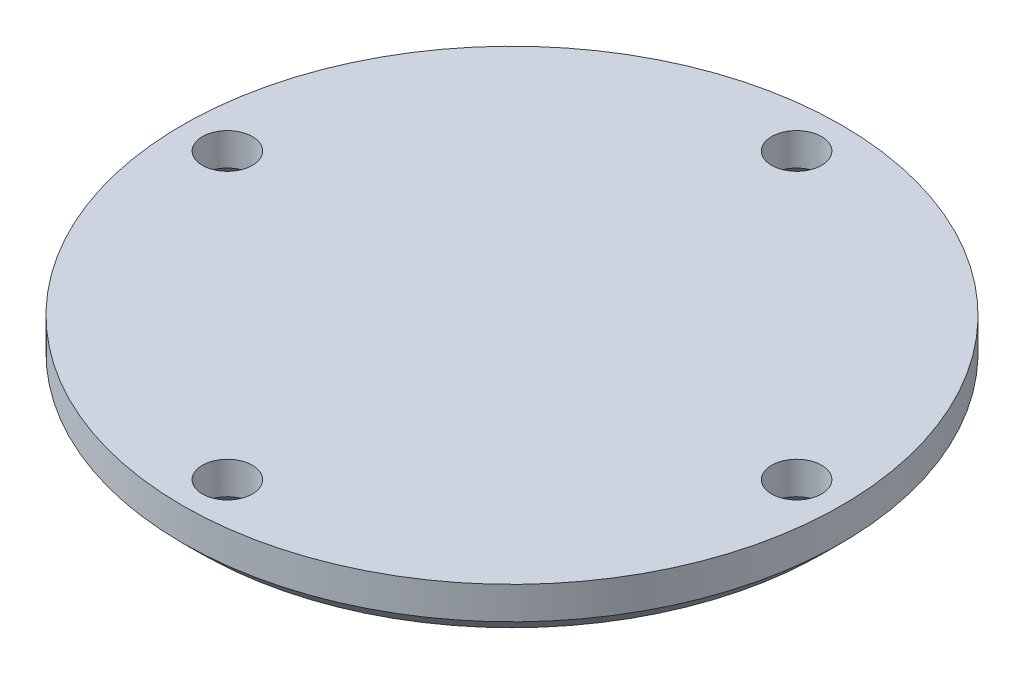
ISO-10303-21;
HEADER;
FILE_DESCRIPTION(('STEP AP214'),'2;1');
FILE_NAME('part.step','',(''),(''),'','','');
FILE_SCHEMA(('AUTOMOTIVE_DESIGN { 1 0 10303 214 1 1 1 1 }'));
ENDSEC;
DATA;
#1=APPLICATION_CONTEXT('core data for automotive mechanical design processes');
#2=APPLICATION_PROTOCOL_DEFINITION('international standard','automotive_design',2000,#1);
#3=PRODUCT_CONTEXT('',#1,'mechanical');
#4=PRODUCT('Part','Part','',(#3));
#5=PRODUCT_RELATED_PRODUCT_CATEGORY('part','',(#4));
#6=PRODUCT_DEFINITION_FORMATION('','',#4);
#7=PRODUCT_DEFINITION_CONTEXT('part definition',#1,'design');
#8=PRODUCT_DEFINITION('design','',#6,#7);
#9=PRODUCT_DEFINITION_SHAPE('','',#8);
#10=(LENGTH_UNIT() NAMED_UNIT(*) SI_UNIT(.MILLI.,.METRE.));
#11=(NAMED_UNIT(*) PLANE_ANGLE_UNIT() SI_UNIT($,.RADIAN.));
#12=(NAMED_UNIT(*) SI_UNIT($,.STERADIAN.) SOLID_ANGLE_UNIT());
#13=UNCERTAINTY_MEASURE_WITH_UNIT(LENGTH_MEASURE(1.E-05),#10,'distance_accuracy_value','');
#14=(GEOMETRIC_REPRESENTATION_CONTEXT(3) GLOBAL_UNCERTAINTY_ASSIGNED_CONTEXT((#13)) GLOBAL_UNIT_ASSIGNED_CONTEXT((#10,
#11,#12)) REPRESENTATION_CONTEXT('',''));
#15=CARTESIAN_POINT('',(0.,0.,0.));
#16=DIRECTION('',(0.,0.,1.));
#17=DIRECTION('',(1.,0.,0.));
#18=AXIS2_PLACEMENT_3D('',#15,#16,#17);
#19=CARTESIAN_POINT('',(0.,5.,0.));
#20=DIRECTION('',(0.,-1.,0.));
#21=DIRECTION('',(0.,0.,-1.));
#22=AXIS2_PLACEMENT_3D('',#19,#20,#21);
#23=CYLINDRICAL_SURFACE('',#22,33.);
#24=CARTESIAN_POINT('',(0.,1.75000000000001,0.));
#25=DIRECTION('',(0.,1.,0.));
#26=DIRECTION('',(0.,0.,1.));
#27=AXIS2_PLACEMENT_3D('',#24,#25,#26);
#28=CIRCLE('',#27,33.);
#29=CARTESIAN_POINT('',(0.,1.75000000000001,33.));
#30=VERTEX_POINT('',#29);
#31=EDGE_CURVE('E114',#30,#30,#28,.T.);
#32=ORIENTED_EDGE('',*,*,#31,.T.);
#33=EDGE_LOOP('',(#32));
#34=FACE_BOUND('',#33,.T.);
#35=CARTESIAN_POINT('',(0.,5.,0.));
#36=DIRECTION('',(0.,1.,0.));
#37=DIRECTION('',(0.,0.,1.));
#38=AXIS2_PLACEMENT_3D('',#35,#36,#37);
#39=CIRCLE('',#38,33.);
#40=CARTESIAN_POINT('',(0.,5.,33.));
#41=VERTEX_POINT('',#40);
#42=EDGE_CURVE('E118',#41,#41,#39,.T.);
#43=ORIENTED_EDGE('',*,*,#42,.F.);
#44=EDGE_LOOP('',(#43));
#45=FACE_BOUND('',#44,.T.);
#46=ADVANCED_FACE('F43',(#34,#45),#23,.T.);
#47=CARTESIAN_POINT('',(0.,5.,0.));
#48=DIRECTION('',(0.,1.,0.));
#49=DIRECTION('',(0.,0.,1.));
#50=AXIS2_PLACEMENT_3D('',#47,#48,#49);
#51=PLANE('',#50);
#52=CARTESIAN_POINT('',(0.,5.,-28.5));
#53=DIRECTION('',(0.,1.,0.));
#54=DIRECTION('',(0.,0.,1.));
#55=AXIS2_PLACEMENT_3D('',#52,#53,#54);
#56=CIRCLE('',#55,2.5);
#57=CARTESIAN_POINT('',(0.,5.,-26.));
#58=VERTEX_POINT('',#57);
#59=EDGE_CURVE('E265',#58,#58,#56,.T.);
#60=ORIENTED_EDGE('',*,*,#59,.F.);
#61=EDGE_LOOP('',(#60));
#62=FACE_BOUND('',#61,.T.);
#63=CARTESIAN_POINT('',(28.5000000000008,5.,-8.04783353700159E-13));
#64=DIRECTION('',(0.,1.,0.));
#65=DIRECTION('',(0.,0.,1.));
#66=AXIS2_PLACEMENT_3D('',#63,#64,#65);
#67=CIRCLE('',#66,2.50000000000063);
#68=CARTESIAN_POINT('',(28.5000000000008,5.,2.49999999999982));
#69=VERTEX_POINT('',#68);
#70=EDGE_CURVE('E267',#69,#69,#67,.T.);
#71=ORIENTED_EDGE('',*,*,#70,.F.);
#72=EDGE_LOOP('',(#71));
#73=FACE_BOUND('',#72,.T.);
#74=CARTESIAN_POINT('',(1.60956670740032E-12,5.,28.5));
#75=DIRECTION('',(0.,1.,0.));
#76=DIRECTION('',(0.,0.,1.));
#77=AXIS2_PLACEMENT_3D('',#74,#75,#76);
#78=CIRCLE('',#77,2.50000000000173);
#79=CARTESIAN_POINT('',(1.60956670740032E-12,5.,31.0000000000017));
#80=VERTEX_POINT('',#79);
#81=EDGE_CURVE('E273',#80,#80,#78,.T.);
#82=ORIENTED_EDGE('',*,*,#81,.F.);
#83=EDGE_LOOP('',(#82));
#84=FACE_BOUND('',#83,.T.);
#85=CARTESIAN_POINT('',(-28.4999999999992,5.,8.08273597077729E-13));
#86=DIRECTION('',(0.,1.,0.));
#87=DIRECTION('',(0.,0.,1.));
#88=AXIS2_PLACEMENT_3D('',#85,#86,#87);
#89=CIRCLE('',#88,2.50000000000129);
#90=CARTESIAN_POINT('',(-28.4999999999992,5.,2.5000000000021));
#91=VERTEX_POINT('',#90);
#92=EDGE_CURVE('E214',#91,#91,#89,.T.);
#93=ORIENTED_EDGE('',*,*,#92,.F.);
#94=EDGE_LOOP('',(#93));
#95=FACE_BOUND('',#94,.T.);
#96=ORIENTED_EDGE('',*,*,#42,.T.);
#97=EDGE_LOOP('',(#96));
#98=FACE_BOUND('',#97,.T.);
#99=ADVANCED_FACE('F234',(#62,#73,#84,#95,#98),#51,.T.);
#100=CARTESIAN_POINT('',(0.,0.,0.));
#101=DIRECTION('',(0.,1.,0.));
#102=DIRECTION('',(0.,0.,1.));
#103=AXIS2_PLACEMENT_3D('',#100,#101,#102);
#104=PLANE('',#103);
#105=CARTESIAN_POINT('',(28.5000000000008,0.,-8.04783353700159E-13));
#106=DIRECTION('',(0.,1.,0.));
#107=DIRECTION('',(0.,0.,1.));
#108=AXIS2_PLACEMENT_3D('',#105,#106,#107);
#109=CIRCLE('',#108,4.25000000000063);
#110=CARTESIAN_POINT('',(28.5000000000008,0.,4.24999999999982));
#111=VERTEX_POINT('',#110);
#112=CARTESIAN_POINT('',(31.0657894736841,0.,3.38810040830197));
#113=VERTEX_POINT('',#112);
#114=EDGE_CURVE('E72',#111,#113,#109,.T.);
#115=ORIENTED_EDGE('',*,*,#114,.T.);
#116=CARTESIAN_POINT('',(0.,0.,0.));
#117=DIRECTION('',(0.,1.,0.));
#118=DIRECTION('',(0.,0.,1.));
#119=AXIS2_PLACEMENT_3D('',#116,#117,#118);
#120=CIRCLE('',#119,31.25);
#121=CARTESIAN_POINT('',(3.38810040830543,0.,31.0657894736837));
#122=VERTEX_POINT('',#121);
#123=EDGE_CURVE('E67',#113,#122,#120,.F.);
#124=ORIENTED_EDGE('',*,*,#123,.T.);
#125=CARTESIAN_POINT('',(1.60956670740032E-12,0.,28.5));
#126=DIRECTION('',(0.,1.,0.));
#127=DIRECTION('',(0.,0.,1.));
#128=AXIS2_PLACEMENT_3D('',#125,#126,#127);
#129=CIRCLE('',#128,4.25000000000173);
#130=CARTESIAN_POINT('',(-3.38810040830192,0.,31.0657894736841));
#131=VERTEX_POINT('',#130);
#132=EDGE_CURVE('E141',#122,#131,#129,.T.);
#133=ORIENTED_EDGE('',*,*,#132,.T.);
#134=CARTESIAN_POINT('',(0.,0.,0.));
#135=DIRECTION('',(0.,1.,0.));
#136=DIRECTION('',(0.,0.,1.));
#137=AXIS2_PLACEMENT_3D('',#134,#135,#136);
#138=CIRCLE('',#137,31.25);
#139=CARTESIAN_POINT('',(-31.065789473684,0.,3.38810040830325));
#140=VERTEX_POINT('',#139);
#141=EDGE_CURVE('E136',#131,#140,#138,.F.);
#142=ORIENTED_EDGE('',*,*,#141,.T.);
#143=CARTESIAN_POINT('',(-28.4999999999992,0.,8.08273597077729E-13));
#144=DIRECTION('',(0.,1.,0.));
#145=DIRECTION('',(0.,0.,1.));
#146=AXIS2_PLACEMENT_3D('',#143,#144,#145);
#147=CIRCLE('',#146,4.25000000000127);
#148=CARTESIAN_POINT('',(-28.4999999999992,0.,4.25000000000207));
#149=VERTEX_POINT('',#148);
#150=EDGE_CURVE('E133',#140,#149,#147,.T.);
#151=ORIENTED_EDGE('',*,*,#150,.T.);
#152=CARTESIAN_POINT('',(-28.4999999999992,0.,8.08273597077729E-13));
#153=DIRECTION('',(0.,1.,0.));
#154=DIRECTION('',(0.,0.,1.));
#155=AXIS2_PLACEMENT_3D('',#152,#153,#154);
#156=CIRCLE('',#155,4.25000000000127);
#157=CARTESIAN_POINT('',(-31.0657894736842,0.,-3.38810040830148));
#158=VERTEX_POINT('',#157);
#159=EDGE_CURVE('E130',#149,#158,#156,.T.);
#160=ORIENTED_EDGE('',*,*,#159,.T.);
#161=CARTESIAN_POINT('',(0.,0.,0.));
#162=DIRECTION('',(0.,1.,0.));
#163=DIRECTION('',(0.,0.,1.));
#164=AXIS2_PLACEMENT_3D('',#161,#162,#163);
#165=CIRCLE('',#164,31.25);
#166=CARTESIAN_POINT('',(-3.38810040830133,0.,-31.0657894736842));
#167=VERTEX_POINT('',#166);
#168=EDGE_CURVE('E106',#158,#167,#165,.F.);
#169=ORIENTED_EDGE('',*,*,#168,.T.);
#170=CARTESIAN_POINT('',(0.,0.,-28.5));
#171=DIRECTION('',(0.,1.,0.));
#172=DIRECTION('',(0.,0.,1.));
#173=AXIS2_PLACEMENT_3D('',#170,#171,#172);
#174=CIRCLE('',#173,4.25000000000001);
#175=CARTESIAN_POINT('',(0.,0.,-24.25));
#176=VERTEX_POINT('',#175);
#177=EDGE_CURVE('E99',#167,#176,#174,.T.);
#178=ORIENTED_EDGE('',*,*,#177,.T.);
#179=CARTESIAN_POINT('',(0.,0.,-28.5));
#180=DIRECTION('',(0.,1.,0.));
#181=DIRECTION('',(0.,0.,1.));
#182=AXIS2_PLACEMENT_3D('',#179,#180,#181);
#183=CIRCLE('',#182,4.25000000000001);
#184=CARTESIAN_POINT('',(3.38810040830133,0.,-31.0657894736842));
#185=VERTEX_POINT('',#184);
#186=EDGE_CURVE('E103',#176,#185,#183,.T.);
#187=ORIENTED_EDGE('',*,*,#186,.T.);
#188=CARTESIAN_POINT('',(0.,0.,0.));
#189=DIRECTION('',(0.,1.,0.));
#190=DIRECTION('',(0.,0.,1.));
#191=AXIS2_PLACEMENT_3D('',#188,#189,#190);
#192=CIRCLE('',#191,31.25);
#193=CARTESIAN_POINT('',(31.0657894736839,0.,-3.38810040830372));
#194=VERTEX_POINT('',#193);
#195=EDGE_CURVE('E124',#185,#194,#192,.F.);
#196=ORIENTED_EDGE('',*,*,#195,.T.);
#197=CARTESIAN_POINT('',(28.5000000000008,0.,-8.04783353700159E-13));
#198=DIRECTION('',(0.,1.,0.));
#199=DIRECTION('',(0.,0.,1.));
#200=AXIS2_PLACEMENT_3D('',#197,#198,#199);
#201=CIRCLE('',#200,4.25000000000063);
#202=EDGE_CURVE('E127',#194,#111,#201,.T.);
#203=ORIENTED_EDGE('',*,*,#202,.T.);
#204=EDGE_LOOP('',(#115,#124,#133,#142,#151,#160,#169,#178,#187,#196,#203));
#205=FACE_BOUND('',#204,.T.);
#206=ADVANCED_FACE('F101',(#205),#104,.F.);
#207=CARTESIAN_POINT('',(-28.4999999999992,0.,8.08273597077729E-13));
#208=DIRECTION('',(0.,1.,0.));
#209=DIRECTION('',(0.,0.,1.));
#210=AXIS2_PLACEMENT_3D('',#207,#208,#209);
#211=CYLINDRICAL_SURFACE('',#210,2.50000000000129);
#212=CARTESIAN_POINT('',(-28.4999999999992,1.74999999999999,8.08273597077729E-13));
#213=DIRECTION('',(0.,1.,0.));
#214=DIRECTION('',(0.,0.,1.));
#215=AXIS2_PLACEMENT_3D('',#212,#213,#214);
#216=CIRCLE('',#215,2.50000000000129);
#217=CARTESIAN_POINT('',(-28.4999999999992,1.74999999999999,2.5000000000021));
#218=VERTEX_POINT('',#217);
#219=EDGE_CURVE('E146',#218,#218,#216,.F.);
#220=ORIENTED_EDGE('',*,*,#219,.T.);
#221=EDGE_LOOP('',(#220));
#222=FACE_BOUND('',#221,.T.);
#223=ORIENTED_EDGE('',*,*,#92,.T.);
#224=EDGE_LOOP('',(#223));
#225=FACE_BOUND('',#224,.T.);
#226=ADVANCED_FACE('F244',(#222,#225),#211,.F.);
#227=CARTESIAN_POINT('',(1.60956670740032E-12,0.,28.5));
#228=DIRECTION('',(0.,1.,0.));
#229=DIRECTION('',(0.,0.,1.));
#230=AXIS2_PLACEMENT_3D('',#227,#228,#229);
#231=CYLINDRICAL_SURFACE('',#230,2.50000000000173);
#232=CARTESIAN_POINT('',(1.60956670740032E-12,1.75000000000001,28.5));
#233=DIRECTION('',(0.,1.,0.));
#234=DIRECTION('',(0.,0.,1.));
#235=AXIS2_PLACEMENT_3D('',#232,#233,#234);
#236=CIRCLE('',#235,2.50000000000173);
#237=CARTESIAN_POINT('',(1.60956670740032E-12,1.75000000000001,31.0000000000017));
#238=VERTEX_POINT('',#237);
#239=EDGE_CURVE('E150',#238,#238,#236,.F.);
#240=ORIENTED_EDGE('',*,*,#239,.T.);
#241=EDGE_LOOP('',(#240));
#242=FACE_BOUND('',#241,.T.);
#243=ORIENTED_EDGE('',*,*,#81,.T.);
#244=EDGE_LOOP('',(#243));
#245=FACE_BOUND('',#244,.T.);
#246=ADVANCED_FACE('F248',(#242,#245),#231,.F.);
#247=CARTESIAN_POINT('',(28.5000000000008,0.,-8.04783353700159E-13));
#248=DIRECTION('',(0.,1.,0.));
#249=DIRECTION('',(0.,0.,1.));
#250=AXIS2_PLACEMENT_3D('',#247,#248,#249);
#251=CYLINDRICAL_SURFACE('',#250,2.50000000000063);
#252=CARTESIAN_POINT('',(28.5000000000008,1.75,-8.04783353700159E-13));
#253=DIRECTION('',(0.,1.,0.));
#254=DIRECTION('',(0.,0.,1.));
#255=AXIS2_PLACEMENT_3D('',#252,#253,#254);
#256=CIRCLE('',#255,2.50000000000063);
#257=CARTESIAN_POINT('',(28.5000000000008,1.75,2.49999999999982));
#258=VERTEX_POINT('',#257);
#259=EDGE_CURVE('E59',#258,#258,#256,.F.);
#260=ORIENTED_EDGE('',*,*,#259,.T.);
#261=EDGE_LOOP('',(#260));
#262=FACE_BOUND('',#261,.T.);
#263=ORIENTED_EDGE('',*,*,#70,.T.);
#264=EDGE_LOOP('',(#263));
#265=FACE_BOUND('',#264,.T.);
#266=ADVANCED_FACE('F252',(#262,#265),#251,.F.);
#267=CARTESIAN_POINT('',(0.,0.,-28.5));
#268=DIRECTION('',(0.,1.,0.));
#269=DIRECTION('',(0.,0.,1.));
#270=AXIS2_PLACEMENT_3D('',#267,#268,#269);
#271=CYLINDRICAL_SURFACE('',#270,2.5);
#272=CARTESIAN_POINT('',(0.,1.75000000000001,-28.5));
#273=DIRECTION('',(0.,1.,0.));
#274=DIRECTION('',(0.,0.,1.));
#275=AXIS2_PLACEMENT_3D('',#272,#273,#274);
#276=CIRCLE('',#275,2.5);
#277=CARTESIAN_POINT('',(0.,1.75000000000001,-26.));
#278=VERTEX_POINT('',#277);
#279=EDGE_CURVE('E11',#278,#278,#276,.F.);
#280=ORIENTED_EDGE('',*,*,#279,.T.);
#281=EDGE_LOOP('',(#280));
#282=FACE_BOUND('',#281,.T.);
#283=ORIENTED_EDGE('',*,*,#59,.T.);
#284=EDGE_LOOP('',(#283));
#285=FACE_BOUND('',#284,.T.);
#286=ADVANCED_FACE('F230',(#282,#285),#271,.F.);
#287=CARTESIAN_POINT('',(0.,0.,-28.5));
#288=DIRECTION('',(0.,-1.,0.));
#289=DIRECTION('',(0.,0.,-1.));
#290=AXIS2_PLACEMENT_3D('',#287,#288,#289);
#291=CONICAL_SURFACE('',#290,4.25000000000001,0.785398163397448);
#292=ORIENTED_EDGE('',*,*,#279,.F.);
#293=EDGE_LOOP('',(#292));
#294=FACE_BOUND('',#293,.T.);
#295=ORIENTED_EDGE('',*,*,#186,.F.);
#296=ORIENTED_EDGE('',*,*,#177,.F.);
#297=CARTESIAN_POINT('',(3.38853991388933,-0.0002,-31.0655403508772));
#298=CARTESIAN_POINT('',(3.22973589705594,0.0720753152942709,-31.1555674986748));
#299=CARTESIAN_POINT('',(3.0664884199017,0.140700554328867,-31.2410480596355));
#300=CARTESIAN_POINT('',(2.73096826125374,0.269374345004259,-31.4013259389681));
#301=CARTESIAN_POINT('',(2.55867100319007,0.329397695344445,-31.4760918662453));
#302=CARTESIAN_POINT('',(2.20485188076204,0.439463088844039,-31.6131908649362));
#303=CARTESIAN_POINT('',(2.02328420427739,0.489447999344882,-31.6754527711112));
#304=CARTESIAN_POINT('',(1.65302149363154,0.577367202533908,-31.7849661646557));
#305=CARTESIAN_POINT('',(1.46433572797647,0.615316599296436,-31.8322364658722));
#306=CARTESIAN_POINT('',(1.13594494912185,0.668892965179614,-31.8989719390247));
#307=CARTESIAN_POINT('',(0.99759149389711,0.687799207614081,-31.9225218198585));
#308=CARTESIAN_POINT('',(0.718860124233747,0.718333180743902,-31.9605553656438));
#309=CARTESIAN_POINT('',(0.578482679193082,0.72996257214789,-31.9750410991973));
#310=CARTESIAN_POINT('',(0.297289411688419,0.745630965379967,-31.9945578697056));
#311=CARTESIAN_POINT('',(0.156478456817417,0.749704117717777,-31.9996314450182));
#312=CARTESIAN_POINT('',(-0.125180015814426,0.750264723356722,-32.0003297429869));
#313=CARTESIAN_POINT('',(-0.266027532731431,0.746752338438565,-31.9959546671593));
#314=CARTESIAN_POINT('',(-0.546616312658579,0.732234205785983,-31.977870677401));
#315=CARTESIAN_POINT('',(-0.686358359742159,0.721234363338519,-31.9641691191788));
#316=CARTESIAN_POINT('',(-0.963894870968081,0.692009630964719,-31.9277663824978));
#317=CARTESIAN_POINT('',(-1.10168925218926,0.673784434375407,-31.9050648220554));
#318=CARTESIAN_POINT('',(-1.37504514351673,0.630425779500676,-31.8510566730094));
#319=CARTESIAN_POINT('',(-1.51059573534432,0.605265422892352,-31.8197165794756));
#320=CARTESIAN_POINT('',(-1.77826235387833,0.548577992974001,-31.7491059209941));
#321=CARTESIAN_POINT('',(-1.9103772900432,0.517048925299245,-31.7098328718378));
#322=CARTESIAN_POINT('',(-2.28042631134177,0.419129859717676,-31.5878635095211));
#323=CARTESIAN_POINT('',(-2.51373044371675,0.345750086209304,-31.4964606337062));
#324=CARTESIAN_POINT('',(-2.85134887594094,0.223937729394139,-31.3447294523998));
#325=CARTESIAN_POINT('',(-2.96144687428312,0.181554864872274,-31.2919367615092));
#326=CARTESIAN_POINT('',(-3.17781817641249,0.093246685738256,-31.1819388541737));
#327=CARTESIAN_POINT('',(-3.28409489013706,0.0473246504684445,-31.1247377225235));
#328=CARTESIAN_POINT('',(-3.38853991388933,-0.000200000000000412,-31.0655403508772));
#329=B_SPLINE_CURVE_WITH_KNOTS('',3,(#297,#298,#299,#300,#301,#302,#303,#304,#305,#306,#307,
#308,#309,#310,#311,#312,#313,#314,#315,#316,#317,#318,#319,#320,#321,#322,#323,#324,#325,#326,
#327,#328),.UNSPECIFIED.,.F.,.F.,(4,2,2,2,2,2,2,2,2,2,2,2,2,2,2,4),(0.,0.589118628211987,
1.17992940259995,1.77401293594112,2.36734794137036,2.79173382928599,3.21602282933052,
3.63838953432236,4.06074723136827,4.48277220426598,4.904815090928,5.32851849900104,
5.75235479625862,6.53329704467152,6.92090793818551,7.30816389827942),.UNSPECIFIED.);
#330=EDGE_CURVE('E48',#185,#167,#329,.T.);
#331=ORIENTED_EDGE('',*,*,#330,.F.);
#332=EDGE_LOOP('',(#295,#296,#331));
#333=FACE_BOUND('',#332,.T.);
#334=ADVANCED_FACE('F111',(#294,#333),#291,.F.);
#335=CARTESIAN_POINT('',(28.5000000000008,0.,-8.04783353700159E-13));
#336=DIRECTION('',(0.,-1.,0.));
#337=DIRECTION('',(0.,0.,-1.));
#338=AXIS2_PLACEMENT_3D('',#335,#336,#337);
#339=CONICAL_SURFACE('',#338,4.25000000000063,0.785398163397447);
#340=ORIENTED_EDGE('',*,*,#259,.F.);
#341=EDGE_LOOP('',(#340));
#342=FACE_BOUND('',#341,.T.);
#343=ORIENTED_EDGE('',*,*,#114,.F.);
#344=ORIENTED_EDGE('',*,*,#202,.F.);
#345=CARTESIAN_POINT('',(31.0655403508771,-0.0002,3.38853991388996));
#346=CARTESIAN_POINT('',(31.1555674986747,0.0720753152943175,3.22973589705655));
#347=CARTESIAN_POINT('',(31.2410480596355,0.140700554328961,3.06648841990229));
#348=CARTESIAN_POINT('',(31.4013259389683,0.269374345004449,2.73096826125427));
#349=CARTESIAN_POINT('',(31.4760918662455,0.329397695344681,2.55867100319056));
#350=CARTESIAN_POINT('',(31.6131908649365,0.439463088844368,2.20485188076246));
#351=CARTESIAN_POINT('',(31.6754527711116,0.489447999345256,2.02328420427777));
#352=CARTESIAN_POINT('',(31.7849661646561,0.577367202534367,1.65302149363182));
#353=CARTESIAN_POINT('',(31.8322364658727,0.615316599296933,1.4643357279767));
#354=CARTESIAN_POINT('',(31.8989719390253,0.668892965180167,1.13594494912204));
#355=CARTESIAN_POINT('',(31.922521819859,0.687799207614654,0.997591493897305));
#356=CARTESIAN_POINT('',(31.9605553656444,0.718333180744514,0.718860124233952));
#357=CARTESIAN_POINT('',(31.9750410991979,0.72996257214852,0.578482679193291));
#358=CARTESIAN_POINT('',(31.9945578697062,0.745630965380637,0.297289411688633));
#359=CARTESIAN_POINT('',(31.9996314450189,0.749704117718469,0.156478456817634));
#360=CARTESIAN_POINT('',(32.0003297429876,0.750264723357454,-0.125180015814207));
#361=CARTESIAN_POINT('',(31.9959546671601,0.746752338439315,-0.266027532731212));
#362=CARTESIAN_POINT('',(31.9778706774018,0.732234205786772,-0.546616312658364));
#363=CARTESIAN_POINT('',(31.9641691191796,0.721234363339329,-0.686358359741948));
#364=CARTESIAN_POINT('',(31.9277663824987,0.692009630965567,-0.96389487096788));
#365=CARTESIAN_POINT('',(31.9050648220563,0.673784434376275,-1.10168925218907));
#366=CARTESIAN_POINT('',(31.8510566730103,0.630425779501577,-1.37504514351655));
#367=CARTESIAN_POINT('',(31.8197165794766,0.605265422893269,-1.51059573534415));
#368=CARTESIAN_POINT('',(31.7491059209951,0.548577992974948,-1.77826235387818));
#369=CARTESIAN_POINT('',(31.7098328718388,0.517048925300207,-1.91037729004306));
#370=CARTESIAN_POINT('',(31.587863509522,0.419129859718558,-2.28042631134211));
#371=CARTESIAN_POINT('',(31.4964606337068,0.345750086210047,-2.51373044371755));
#372=CARTESIAN_POINT('',(31.3447294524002,0.223937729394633,-2.85134887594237));
#373=CARTESIAN_POINT('',(31.2919367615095,0.181554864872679,-2.96144687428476));
#374=CARTESIAN_POINT('',(31.1819388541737,0.0932466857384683,-3.17781817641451));
#375=CARTESIAN_POINT('',(31.1247377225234,0.0473246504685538,-3.28409489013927));
#376=CARTESIAN_POINT('',(31.0655403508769,-0.000200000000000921,-3.38853991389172));
#377=B_SPLINE_CURVE_WITH_KNOTS('',3,(#345,#346,#347,#348,#349,#350,#351,#352,#353,#354,#355,
#356,#357,#358,#359,#360,#361,#362,#363,#364,#365,#366,#367,#368,#369,#370,#371,#372,#373,#374,
#375,#376),.UNSPECIFIED.,.F.,.F.,(4,2,2,2,2,2,2,2,2,2,2,2,2,2,2,4),(0.,0.589118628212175,
1.17992940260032,1.77401293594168,2.36734794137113,2.79173382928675,3.21602282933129,
3.63838953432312,4.06074723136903,4.48277220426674,4.90481509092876,5.3285184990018,
5.75235479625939,6.5332970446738,6.92090793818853,7.30816389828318),.UNSPECIFIED.);
#378=EDGE_CURVE('E204',#113,#194,#377,.T.);
#379=ORIENTED_EDGE('',*,*,#378,.F.);
#380=EDGE_LOOP('',(#343,#344,#379));
#381=FACE_BOUND('',#380,.T.);
#382=ADVANCED_FACE('F196',(#342,#381),#339,.F.);
#383=CARTESIAN_POINT('',(1.60956670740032E-12,0.,28.5));
#384=DIRECTION('',(0.,-1.,0.));
#385=DIRECTION('',(0.,0.,-1.));
#386=AXIS2_PLACEMENT_3D('',#383,#384,#385);
#387=CONICAL_SURFACE('',#386,4.25000000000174,0.785398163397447);
#388=ORIENTED_EDGE('',*,*,#239,.F.);
#389=EDGE_LOOP('',(#388));
#390=FACE_BOUND('',#389,.T.);
#391=CARTESIAN_POINT('',(-3.38853991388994,-0.000199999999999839,31.0655403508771));
#392=CARTESIAN_POINT('',(-3.22973589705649,0.072075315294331,31.1555674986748));
#393=CARTESIAN_POINT('',(-3.06648841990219,0.140700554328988,31.2410480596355));
#394=CARTESIAN_POINT('',(-2.73096826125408,0.2693743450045,31.4013259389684));
#395=CARTESIAN_POINT('',(-2.55867100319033,0.329397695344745,31.4760918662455));
#396=CARTESIAN_POINT('',(-2.20485188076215,0.439463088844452,31.6131908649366));
#397=CARTESIAN_POINT('',(-2.02328420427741,0.489447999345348,31.6754527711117));
#398=CARTESIAN_POINT('',(-1.65302149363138,0.577367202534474,31.7849661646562));
#399=CARTESIAN_POINT('',(-1.46433572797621,0.615316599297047,31.8322364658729));
#400=CARTESIAN_POINT('',(-1.13594494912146,0.668892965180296,31.8989719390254));
#401=CARTESIAN_POINT('',(-0.99759149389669,0.687799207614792,31.9225218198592));
#402=CARTESIAN_POINT('',(-0.718860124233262,0.718333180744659,31.9605553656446));
#403=CARTESIAN_POINT('',(-0.578482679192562,0.729962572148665,31.9750410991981));
#404=CARTESIAN_POINT('',(-0.297289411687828,0.745630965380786,31.9945578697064));
#405=CARTESIAN_POINT('',(-0.15647845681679,0.74970411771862,31.999631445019));
#406=CARTESIAN_POINT('',(0.125180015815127,0.750264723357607,32.0003297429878));
#407=CARTESIAN_POINT('',(0.266027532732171,0.746752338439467,31.9959546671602));
#408=CARTESIAN_POINT('',(0.546616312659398,0.732234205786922,31.977870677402));
#409=CARTESIAN_POINT('',(0.68635835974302,0.721234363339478,31.9641691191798));
#410=CARTESIAN_POINT('',(0.963894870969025,0.692009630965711,31.9277663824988));
#411=CARTESIAN_POINT('',(1.10168925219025,0.673784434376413,31.9050648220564));
#412=CARTESIAN_POINT('',(1.3750451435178,0.630425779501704,31.8510566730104));
#413=CARTESIAN_POINT('',(1.51059573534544,0.60526542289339,31.8197165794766));
#414=CARTESIAN_POINT('',(1.77826235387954,0.548577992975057,31.7491059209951));
#415=CARTESIAN_POINT('',(1.91037729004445,0.517048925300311,31.7098328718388));
#416=CARTESIAN_POINT('',(2.28042631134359,0.419129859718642,31.5878635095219));
#417=CARTESIAN_POINT('',(2.51373044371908,0.345750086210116,31.4964606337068));
#418=CARTESIAN_POINT('',(2.85134887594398,0.223937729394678,31.3447294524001));
#419=CARTESIAN_POINT('',(2.96144687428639,0.181554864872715,31.2919367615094));
#420=CARTESIAN_POINT('',(3.17781817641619,0.0932466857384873,31.1819388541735));
#421=CARTESIAN_POINT('',(3.28409489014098,0.047324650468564,31.1247377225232));
#422=CARTESIAN_POINT('',(3.38853991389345,-0.000199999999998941,31.0655403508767));
#423=B_SPLINE_CURVE_WITH_KNOTS('',3,(#391,#392,#393,#394,#395,#396,#397,#398,#399,#400,#401,
#402,#403,#404,#405,#406,#407,#408,#409,#410,#411,#412,#413,#414,#415,#416,#417,#418,#419,#420,
#421,#422),.UNSPECIFIED.,.F.,.F.,(4,2,2,2,2,2,2,2,2,2,2,2,2,2,2,4),(0.,0.58911862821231,
1.17992940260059,1.77401293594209,2.36734794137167,2.79173382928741,3.21602282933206,
3.63838953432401,4.06074723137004,4.48277220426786,4.90481509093,5.32851849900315,
5.75235479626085,6.53329704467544,6.92090793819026,7.308163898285),.UNSPECIFIED.);
#424=EDGE_CURVE('E167',#131,#122,#423,.T.);
#425=ORIENTED_EDGE('',*,*,#424,.F.);
#426=ORIENTED_EDGE('',*,*,#132,.F.);
#427=EDGE_LOOP('',(#425,#426));
#428=FACE_BOUND('',#427,.T.);
#429=ADVANCED_FACE('F184',(#390,#428),#387,.F.);
#430=CARTESIAN_POINT('',(-28.4999999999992,0.,8.08273597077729E-13));
#431=DIRECTION('',(0.,-1.,0.));
#432=DIRECTION('',(0.,0.,-1.));
#433=AXIS2_PLACEMENT_3D('',#430,#431,#432);
#434=CONICAL_SURFACE('',#433,4.25000000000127,0.785398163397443);
#435=ORIENTED_EDGE('',*,*,#219,.F.);
#436=EDGE_LOOP('',(#435));
#437=FACE_BOUND('',#436,.T.);
#438=ORIENTED_EDGE('',*,*,#159,.F.);
#439=ORIENTED_EDGE('',*,*,#150,.F.);
#440=CARTESIAN_POINT('',(-31.0655403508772,-0.000199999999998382,-3.3885399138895));
#441=CARTESIAN_POINT('',(-31.1555674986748,0.0720753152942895,-3.22973589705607));
#442=CARTESIAN_POINT('',(-31.2410480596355,0.140700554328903,-3.06648841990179));
#443=CARTESIAN_POINT('',(-31.4013259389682,0.269374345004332,-2.73096826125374));
#444=CARTESIAN_POINT('',(-31.4760918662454,0.329397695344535,-2.55867100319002));
#445=CARTESIAN_POINT('',(-31.6131908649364,0.439463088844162,-2.2048518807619));
#446=CARTESIAN_POINT('',(-31.6754527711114,0.489447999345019,-2.02328420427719));
#447=CARTESIAN_POINT('',(-31.7849661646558,0.577367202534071,-1.65302149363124));
#448=CARTESIAN_POINT('',(-31.8322364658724,0.615316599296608,-1.46433572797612));
#449=CARTESIAN_POINT('',(-31.8989719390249,0.668892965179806,-1.1359449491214));
#450=CARTESIAN_POINT('',(-31.9225218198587,0.687799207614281,-0.997591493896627));
#451=CARTESIAN_POINT('',(-31.960555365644,0.718333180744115,-0.718860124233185));
#452=CARTESIAN_POINT('',(-31.9750410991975,0.729962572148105,-0.578482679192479));
#453=CARTESIAN_POINT('',(-31.9945578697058,0.745630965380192,-0.297289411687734));
#454=CARTESIAN_POINT('',(-31.9996314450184,0.749704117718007,-0.156478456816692));
#455=CARTESIAN_POINT('',(-32.0003297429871,0.750264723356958,0.125180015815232));
#456=CARTESIAN_POINT('',(-31.9959546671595,0.746752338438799,0.266027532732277));
#457=CARTESIAN_POINT('',(-31.9778706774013,0.732234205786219,0.546616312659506));
#458=CARTESIAN_POINT('',(-31.964169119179,0.721234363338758,0.686358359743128));
#459=CARTESIAN_POINT('',(-31.927766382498,0.692009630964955,0.96389487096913));
#460=CARTESIAN_POINT('',(-31.9050648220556,0.67378443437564,1.10168925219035));
#461=CARTESIAN_POINT('',(-31.8510566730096,0.6304257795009,1.3750451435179));
#462=CARTESIAN_POINT('',(-31.8197165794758,0.605265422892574,1.51059573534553));
#463=CARTESIAN_POINT('',(-31.7491059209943,0.548577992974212,1.77826235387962));
#464=CARTESIAN_POINT('',(-31.7098328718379,0.517048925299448,1.91037729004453));
#465=CARTESIAN_POINT('',(-31.5878635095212,0.41912985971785,2.28042631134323));
#466=CARTESIAN_POINT('',(-31.4964606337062,0.345750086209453,2.51373044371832));
#467=CARTESIAN_POINT('',(-31.3447294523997,0.223937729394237,2.85134887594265));
#468=CARTESIAN_POINT('',(-31.2919367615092,0.181554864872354,2.96144687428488));
#469=CARTESIAN_POINT('',(-31.1819388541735,0.0932466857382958,3.17781817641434));
#470=CARTESIAN_POINT('',(-31.1247377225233,0.0473246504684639,3.28409489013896));
#471=CARTESIAN_POINT('',(-31.065540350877,-0.000200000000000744,3.38853991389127));
#472=B_SPLINE_CURVE_WITH_KNOTS('',3,(#440,#441,#442,#443,#444,#445,#446,#447,#448,#449,#450,
#451,#452,#453,#454,#455,#456,#457,#458,#459,#460,#461,#462,#463,#464,#465,#466,#467,#468,#469,
#470,#471),.UNSPECIFIED.,.F.,.F.,(4,2,2,2,2,2,2,2,2,2,2,2,2,2,2,4),(0.,0.58911862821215,
1.17992940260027,1.77401293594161,2.36734794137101,2.79173382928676,3.21602282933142,
3.63838953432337,4.06074723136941,4.48277220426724,4.90481509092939,5.32851849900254,
5.75235479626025,6.5332970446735,6.92090793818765,7.30816389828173),.UNSPECIFIED.);
#473=EDGE_CURVE('E157',#158,#140,#472,.T.);
#474=ORIENTED_EDGE('',*,*,#473,.F.);
#475=EDGE_LOOP('',(#438,#439,#474));
#476=FACE_BOUND('',#475,.T.);
#477=ADVANCED_FACE('F178',(#437,#476),#434,.F.);
#478=CARTESIAN_POINT('',(0.,1.75000000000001,0.));
#479=DIRECTION('',(0.,1.,0.));
#480=DIRECTION('',(0.,0.,1.));
#481=AXIS2_PLACEMENT_3D('',#478,#479,#480);
#482=CONICAL_SURFACE('',#481,33.,0.78539816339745);
#483=ORIENTED_EDGE('',*,*,#195,.F.);
#484=ORIENTED_EDGE('',*,*,#330,.T.);
#485=ORIENTED_EDGE('',*,*,#168,.F.);
#486=ORIENTED_EDGE('',*,*,#473,.T.);
#487=ORIENTED_EDGE('',*,*,#141,.F.);
#488=ORIENTED_EDGE('',*,*,#424,.T.);
#489=ORIENTED_EDGE('',*,*,#123,.F.);
#490=ORIENTED_EDGE('',*,*,#378,.T.);
#491=EDGE_LOOP('',(#483,#484,#485,#486,#487,#488,#489,#490));
#492=FACE_BOUND('',#491,.T.);
#493=ORIENTED_EDGE('',*,*,#31,.F.);
#494=EDGE_LOOP('',(#493));
#495=FACE_BOUND('',#494,.T.);
#496=ADVANCED_FACE('F46',(#492,#495),#482,.T.);
#497=CLOSED_SHELL('',(#46,#99,#206,#226,#246,#266,#286,#334,#382,#429,#477,#496));
#498=MANIFOLD_SOLID_BREP('B2',#497);
#499=ADVANCED_BREP_SHAPE_REPRESENTATION('',(#18,#498),#14);
#500=SHAPE_DEFINITION_REPRESENTATION(#9,#499);
ENDSEC;
END-ISO-10303-21;
